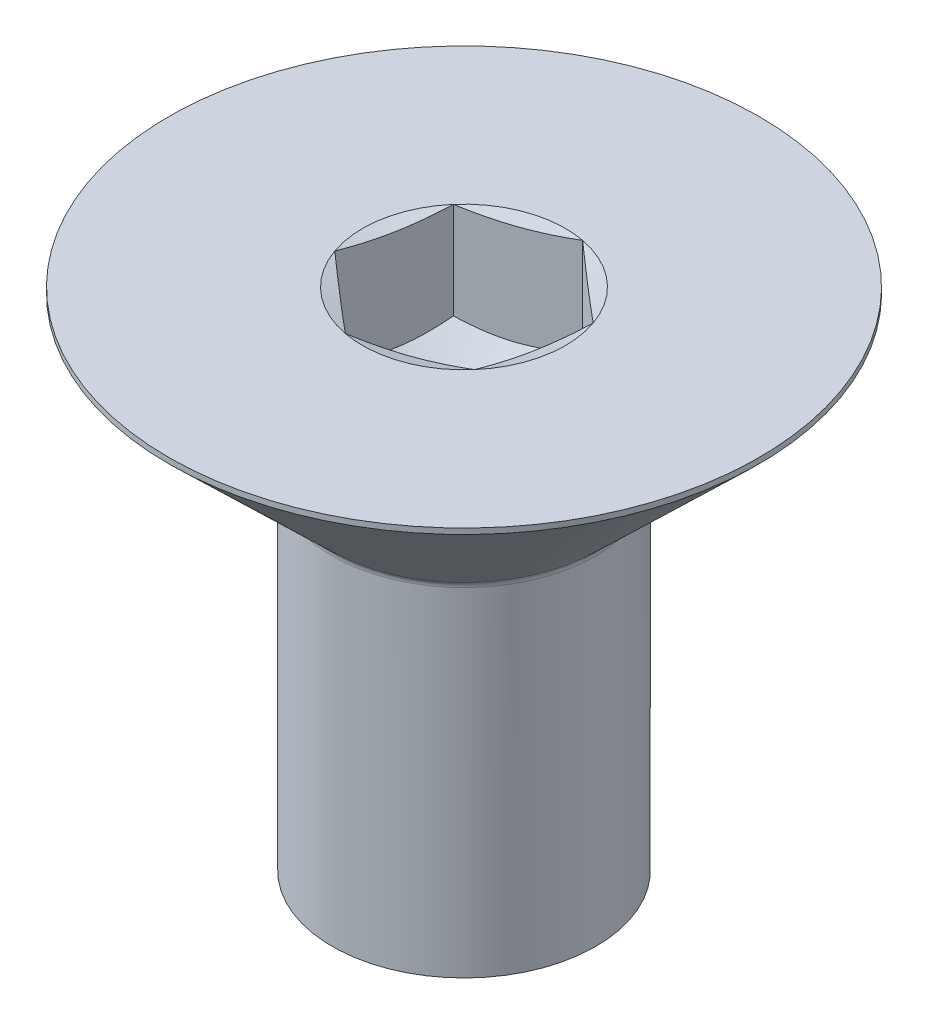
ISO-10303-21;
HEADER;
FILE_DESCRIPTION(('STEP AP214'),'2;1');
FILE_NAME('part.step','',(''),(''),'','','');
FILE_SCHEMA(('AUTOMOTIVE_DESIGN { 1 0 10303 214 1 1 1 1 }'));
ENDSEC;
DATA;
#1=APPLICATION_CONTEXT('core data for automotive mechanical design processes');
#2=APPLICATION_PROTOCOL_DEFINITION('international standard','automotive_design',2000,#1);
#3=PRODUCT_CONTEXT('',#1,'mechanical');
#4=PRODUCT('Part','Part','',(#3));
#5=PRODUCT_RELATED_PRODUCT_CATEGORY('part','',(#4));
#6=PRODUCT_DEFINITION_FORMATION('','',#4);
#7=PRODUCT_DEFINITION_CONTEXT('part definition',#1,'design');
#8=PRODUCT_DEFINITION('design','',#6,#7);
#9=PRODUCT_DEFINITION_SHAPE('','',#8);
#10=(LENGTH_UNIT() NAMED_UNIT(*) SI_UNIT(.MILLI.,.METRE.));
#11=(NAMED_UNIT(*) PLANE_ANGLE_UNIT() SI_UNIT($,.RADIAN.));
#12=(NAMED_UNIT(*) SI_UNIT($,.STERADIAN.) SOLID_ANGLE_UNIT());
#13=UNCERTAINTY_MEASURE_WITH_UNIT(LENGTH_MEASURE(1.E-05),#10,'distance_accuracy_value','');
#14=(GEOMETRIC_REPRESENTATION_CONTEXT(3) GLOBAL_UNCERTAINTY_ASSIGNED_CONTEXT((#13)) GLOBAL_UNIT_ASSIGNED_CONTEXT((#10,
#11,#12)) REPRESENTATION_CONTEXT('',''));
#15=CARTESIAN_POINT('',(0.,0.,0.));
#16=DIRECTION('',(0.,0.,1.));
#17=DIRECTION('',(1.,0.,0.));
#18=AXIS2_PLACEMENT_3D('',#15,#16,#17);
#19=CARTESIAN_POINT('',(1038.73220324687,1026.36700558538,1014.81161803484));
#20=DIRECTION('',(0.,-1.,0.));
#21=DIRECTION('',(-0.94414595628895,0.,0.329527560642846));
#22=AXIS2_PLACEMENT_3D('',#19,#20,#21);
#23=CYLINDRICAL_SURFACE('',#22,1.4999999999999);
#24=CARTESIAN_POINT('',(1038.73220324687,1026.61700558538,1014.81161803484));
#25=DIRECTION('',(0.,1.,0.));
#26=DIRECTION('',(-0.329527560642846,0.,-0.94414595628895));
#27=AXIS2_PLACEMENT_3D('',#24,#25,#26);
#28=CIRCLE('',#27,1.4999999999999);
#29=CARTESIAN_POINT('',(1038.23791190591,1026.61700558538,1013.39539910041));
#30=VERTEX_POINT('',#29);
#31=EDGE_CURVE('E139',#30,#30,#28,.T.);
#32=ORIENTED_EDGE('',*,*,#31,.T.);
#33=EDGE_LOOP('',(#32));
#34=FACE_BOUND('',#33,.T.);
#35=CARTESIAN_POINT('',(1038.73220324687,1030.46455810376,1014.81161803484));
#36=DIRECTION('',(0.,-1.,0.));
#37=DIRECTION('',(-0.94414595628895,0.,0.329527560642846));
#38=AXIS2_PLACEMENT_3D('',#35,#36,#37);
#39=CIRCLE('',#38,1.4999999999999);
#40=CARTESIAN_POINT('',(1037.31598431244,1030.46455810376,1015.3059093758));
#41=VERTEX_POINT('',#40);
#42=EDGE_CURVE('E163',#41,#41,#39,.T.);
#43=ORIENTED_EDGE('',*,*,#42,.T.);
#44=EDGE_LOOP('',(#43));
#45=FACE_BOUND('',#44,.T.);
#46=ADVANCED_FACE('F17',(#34,#45),#23,.T.);
#47=CARTESIAN_POINT('',(1035.55987283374,1032.36700558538,1015.9188306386));
#48=DIRECTION('',(0.,1.,0.));
#49=DIRECTION('',(1.,0.,0.));
#50=AXIS2_PLACEMENT_3D('',#47,#48,#49);
#51=PLANE('',#50);
#52=CARTESIAN_POINT('',(1038.73220324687,1032.36700558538,1014.81161803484));
#53=DIRECTION('',(0.,-1.,0.));
#54=DIRECTION('',(0.944145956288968,0.,-0.329527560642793));
#55=AXIS2_PLACEMENT_3D('',#52,#53,#54);
#56=CIRCLE('',#55,1.15470053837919);
#57=CARTESIAN_POINT('',(1038.94777860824,1032.36700558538,1013.67721925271));
#58=VERTEX_POINT('',#57);
#59=CARTESIAN_POINT('',(1039.8224090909,1032.36700558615,1014.43111238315));
#60=VERTEX_POINT('',#59);
#61=EDGE_CURVE('E108',#58,#60,#56,.T.);
#62=ORIENTED_EDGE('',*,*,#61,.T.);
#63=CARTESIAN_POINT('',(1038.73220324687,1032.36700558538,1014.81161803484));
#64=DIRECTION('',(0.,-1.,0.));
#65=DIRECTION('',(0.944145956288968,0.,-0.329527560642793));
#66=AXIS2_PLACEMENT_3D('',#63,#64,#65);
#67=CIRCLE('',#66,1.15470053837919);
#68=CARTESIAN_POINT('',(1039.60683372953,1032.36700558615,1015.56551116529));
#69=VERTEX_POINT('',#68);
#70=EDGE_CURVE('E180',#60,#69,#67,.T.);
#71=ORIENTED_EDGE('',*,*,#70,.T.);
#72=CARTESIAN_POINT('',(1038.73220324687,1032.36700558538,1014.81161803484));
#73=DIRECTION('',(0.,-1.,0.));
#74=DIRECTION('',(0.944145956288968,0.,-0.329527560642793));
#75=AXIS2_PLACEMENT_3D('',#72,#73,#74);
#76=CIRCLE('',#75,1.15470053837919);
#77=CARTESIAN_POINT('',(1038.51662788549,1032.36700558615,1015.94601681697));
#78=VERTEX_POINT('',#77);
#79=EDGE_CURVE('E178',#69,#78,#76,.T.);
#80=ORIENTED_EDGE('',*,*,#79,.T.);
#81=CARTESIAN_POINT('',(1038.73220324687,1032.36700558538,1014.81161803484));
#82=DIRECTION('',(0.,-1.,0.));
#83=DIRECTION('',(0.944145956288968,0.,-0.329527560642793));
#84=AXIS2_PLACEMENT_3D('',#81,#82,#83);
#85=CIRCLE('',#84,1.15470053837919);
#86=CARTESIAN_POINT('',(1037.64199740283,1032.36700558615,1015.19212368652));
#87=VERTEX_POINT('',#86);
#88=EDGE_CURVE('E112',#78,#87,#85,.T.);
#89=ORIENTED_EDGE('',*,*,#88,.T.);
#90=CARTESIAN_POINT('',(1038.73220324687,1032.36700558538,1014.81161803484));
#91=DIRECTION('',(0.,1.,0.));
#92=DIRECTION('',(-0.329527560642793,0.,-0.944145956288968));
#93=AXIS2_PLACEMENT_3D('',#90,#91,#92);
#94=CIRCLE('',#93,1.15470053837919);
#95=CARTESIAN_POINT('',(1037.85757276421,1032.36700558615,1014.05772490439));
#96=VERTEX_POINT('',#95);
#97=EDGE_CURVE('E93',#96,#87,#94,.T.);
#98=ORIENTED_EDGE('',*,*,#97,.F.);
#99=CARTESIAN_POINT('',(1038.73220324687,1032.36700558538,1014.81161803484));
#100=DIRECTION('',(0.,-1.,0.));
#101=DIRECTION('',(0.944145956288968,0.,-0.329527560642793));
#102=AXIS2_PLACEMENT_3D('',#99,#100,#101);
#103=CIRCLE('',#102,1.15470053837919);
#104=EDGE_CURVE('E100',#96,#58,#103,.T.);
#105=ORIENTED_EDGE('',*,*,#104,.T.);
#106=EDGE_LOOP('',(#62,#71,#80,#89,#98,#105));
#107=FACE_BOUND('',#106,.T.);
#108=CARTESIAN_POINT('',(1038.73220324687,1032.36700558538,1014.81161803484));
#109=DIRECTION('',(0.,-1.,0.));
#110=DIRECTION('',(-0.944145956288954,0.,0.329527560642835));
#111=AXIS2_PLACEMENT_3D('',#108,#109,#110);
#112=CIRCLE('',#111,3.35999999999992);
#113=CARTESIAN_POINT('',(1035.55987283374,1032.36700558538,1015.9188306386));
#114=VERTEX_POINT('',#113);
#115=EDGE_CURVE('E11',#114,#114,#112,.T.);
#116=ORIENTED_EDGE('',*,*,#115,.F.);
#117=EDGE_LOOP('',(#116));
#118=FACE_BOUND('',#117,.T.);
#119=ADVANCED_FACE('F19',(#107,#118),#51,.T.);
#120=CARTESIAN_POINT('',(1038.73220324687,1026.36700558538,1014.81161803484));
#121=DIRECTION('',(0.,-1.,0.));
#122=DIRECTION('',(-0.944145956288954,0.,0.329527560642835));
#123=AXIS2_PLACEMENT_3D('',#120,#121,#122);
#124=CYLINDRICAL_SURFACE('',#123,3.35999999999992);
#125=CARTESIAN_POINT('',(1038.73220324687,1032.30318670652,1014.81161803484));
#126=DIRECTION('',(0.,-1.,0.));
#127=DIRECTION('',(-0.944145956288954,0.,0.329527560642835));
#128=AXIS2_PLACEMENT_3D('',#125,#126,#127);
#129=CIRCLE('',#128,3.35999999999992);
#130=CARTESIAN_POINT('',(1035.55987283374,1032.30318670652,1015.9188306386));
#131=VERTEX_POINT('',#130);
#132=EDGE_CURVE('E34',#131,#131,#129,.T.);
#133=ORIENTED_EDGE('',*,*,#132,.F.);
#134=EDGE_LOOP('',(#133));
#135=FACE_BOUND('',#134,.T.);
#136=ORIENTED_EDGE('',*,*,#115,.T.);
#137=EDGE_LOOP('',(#136));
#138=FACE_BOUND('',#137,.T.);
#139=ADVANCED_FACE('F298',(#135,#138),#124,.T.);
#140=CARTESIAN_POINT('',(1038.73220324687,1030.53649208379,1014.81161803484));
#141=DIRECTION('',(0.,1.,0.));
#142=DIRECTION('',(0.944145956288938,0.,-0.32952756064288));
#143=AXIS2_PLACEMENT_3D('',#140,#141,#142);
#144=CONICAL_SURFACE('',#143,1.53053416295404,0.802851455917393);
#145=ORIENTED_EDGE('',*,*,#132,.T.);
#146=EDGE_LOOP('',(#145));
#147=FACE_BOUND('',#146,.T.);
#148=CARTESIAN_POINT('',(1038.73220324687,1030.53649208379,1014.81161803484));
#149=DIRECTION('',(0.,-1.,0.));
#150=DIRECTION('',(-0.944145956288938,0.,0.32952756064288));
#151=AXIS2_PLACEMENT_3D('',#148,#149,#150);
#152=CIRCLE('',#151,1.53053416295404);
#153=CARTESIAN_POINT('',(1037.28715560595,1030.53649208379,1015.31597122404));
#154=VERTEX_POINT('',#153);
#155=EDGE_CURVE('E162',#154,#154,#152,.T.);
#156=ORIENTED_EDGE('',*,*,#155,.F.);
#157=EDGE_LOOP('',(#156));
#158=FACE_BOUND('',#157,.T.);
#159=ADVANCED_FACE('F295',(#147,#158),#144,.T.);
#160=CARTESIAN_POINT('',(1038.73220324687,1030.46455810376,1014.81161803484));
#161=DIRECTION('',(0.,-1.,0.));
#162=DIRECTION('',(-0.944145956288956,0.,0.329527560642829));
#163=AXIS2_PLACEMENT_3D('',#160,#161,#162);
#164=TOROIDAL_SURFACE('',#163,1.6,0.1);
#165=ORIENTED_EDGE('',*,*,#155,.T.);
#166=EDGE_LOOP('',(#165));
#167=FACE_BOUND('',#166,.T.);
#168=ORIENTED_EDGE('',*,*,#42,.F.);
#169=EDGE_LOOP('',(#168));
#170=FACE_BOUND('',#169,.T.);
#171=ADVANCED_FACE('F297',(#167,#170),#164,.F.);
#172=CARTESIAN_POINT('',(1038.73220324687,2032.03700558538,1014.81161803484));
#173=DIRECTION('',(0.,1.,0.));
#174=DIRECTION('',(-0.329527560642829,0.,-0.944145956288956));
#175=AXIS2_PLACEMENT_3D('',#172,#173,#174);
#176=CONICAL_SURFACE('',#175,3499.09254054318,1.2924281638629);
#177=CARTESIAN_POINT('',(1038.94777860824,1032.36700558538,1013.67721925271));
#178=CARTESIAN_POINT('',(1038.98408327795,1032.36015412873,1013.70851228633));
#179=CARTESIAN_POINT('',(1039.02046264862,1032.35393209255,1013.73986970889));
#180=CARTESIAN_POINT('',(1039.09336747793,1032.34299811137,1013.80271047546));
#181=CARTESIAN_POINT('',(1039.12989299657,1032.33828686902,1013.83419387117));
#182=CARTESIAN_POINT('',(1039.20283855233,1032.33065500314,1013.89706974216));
#183=CARTESIAN_POINT('',(1039.23925795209,1032.32772404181,1013.92846166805));
#184=CARTESIAN_POINT('',(1039.31214952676,1032.32379373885,1013.99129100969));
#185=CARTESIAN_POINT('',(1039.34862168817,1032.32279396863,1014.02272841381));
#186=CARTESIAN_POINT('',(1039.42156601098,1032.32279396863,1014.08560322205));
#187=CARTESIAN_POINT('',(1039.45803817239,1032.32379373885,1014.11704062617));
#188=CARTESIAN_POINT('',(1039.53092974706,1032.32772404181,1014.17986996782));
#189=CARTESIAN_POINT('',(1039.56734914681,1032.33065500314,1014.2112618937));
#190=CARTESIAN_POINT('',(1039.64029470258,1032.33828686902,1014.27413776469));
#191=CARTESIAN_POINT('',(1039.67682022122,1032.34299811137,1014.3056211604));
#192=CARTESIAN_POINT('',(1039.74972505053,1032.35393209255,1014.36846192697));
#193=CARTESIAN_POINT('',(1039.78610442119,1032.36015412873,1014.39981934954));
#194=CARTESIAN_POINT('',(1039.8224090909,1032.36700558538,1014.43111238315));
#195=B_SPLINE_CURVE_WITH_KNOTS('',3,(#177,#178,#179,#180,#181,#182,#183,#184,#185,#186,#187,
#188,#189,#190,#191,#192,#193,#194),.UNSPECIFIED.,.F.,.F.,(4,2,2,2,2,2,2,2,4),(0.,
0.145260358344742,0.290588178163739,0.435063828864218,0.579507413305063,0.723950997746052,
0.86842664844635,1.01375446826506,1.15901482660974),.UNSPECIFIED.);
#196=EDGE_CURVE('E201',#58,#60,#195,.T.);
#197=ORIENTED_EDGE('',*,*,#196,.T.);
#198=ORIENTED_EDGE('',*,*,#61,.F.);
#199=EDGE_LOOP('',(#197,#198));
#200=FACE_BOUND('',#199,.T.);
#201=ADVANCED_FACE('F293',(#200),#176,.F.);
#202=CARTESIAN_POINT('',(1038.73220324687,2032.03700558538,1014.81161803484));
#203=DIRECTION('',(0.,1.,0.));
#204=DIRECTION('',(-0.329527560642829,0.,-0.944145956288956));
#205=AXIS2_PLACEMENT_3D('',#202,#203,#204);
#206=CONICAL_SURFACE('',#205,3499.09254054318,1.2924281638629);
#207=ORIENTED_EDGE('',*,*,#104,.F.);
#208=CARTESIAN_POINT('',(1037.85757276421,1032.36700558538,1014.05772490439));
#209=CARTESIAN_POINT('',(1037.90282566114,1032.36015412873,1014.04193065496));
#210=CARTESIAN_POINT('',(1037.94817167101,1032.35393209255,1014.02610390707));
#211=CARTESIAN_POINT('',(1038.03904578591,1032.34299811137,1013.99438685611));
#212=CARTESIAN_POINT('',(1038.08457396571,1032.33828686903,1013.97849652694));
#213=CARTESIAN_POINT('',(1038.17549884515,1032.33065500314,1013.94676175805));
#214=CARTESIAN_POINT('',(1038.22089475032,1032.32772404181,1013.93091759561));
#215=CARTESIAN_POINT('',(1038.31175234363,1032.32379373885,1013.89920631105));
#216=CARTESIAN_POINT('',(1038.35721401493,1032.32279396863,1013.8833391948));
#217=CARTESIAN_POINT('',(1038.44813735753,1032.32279396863,1013.8516049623));
#218=CARTESIAN_POINT('',(1038.49359902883,1032.32379373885,1013.83573784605));
#219=CARTESIAN_POINT('',(1038.58445662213,1032.32772404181,1013.80402656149));
#220=CARTESIAN_POINT('',(1038.6298525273,1032.33065500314,1013.78818239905));
#221=CARTESIAN_POINT('',(1038.72077740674,1032.33828686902,1013.75644763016));
#222=CARTESIAN_POINT('',(1038.76630558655,1032.34299811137,1013.74055730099));
#223=CARTESIAN_POINT('',(1038.85717970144,1032.35393209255,1013.70884025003));
#224=CARTESIAN_POINT('',(1038.90252571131,1032.36015412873,1013.69301350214));
#225=CARTESIAN_POINT('',(1038.94777860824,1032.36700558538,1013.67721925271));
#226=B_SPLINE_CURVE_WITH_KNOTS('',3,(#208,#209,#210,#211,#212,#213,#214,#215,#216,#217,#218,
#219,#220,#221,#222,#223,#224,#225),.UNSPECIFIED.,.F.,.F.,(4,2,2,2,2,2,2,2,4),(0.,
0.145260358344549,0.290588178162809,0.435063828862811,0.579507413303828,0.723950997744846,
0.868426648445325,1.01375446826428,1.15901482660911),.UNSPECIFIED.);
#227=EDGE_CURVE('E103',#96,#58,#226,.T.);
#228=ORIENTED_EDGE('',*,*,#227,.T.);
#229=EDGE_LOOP('',(#207,#228));
#230=FACE_BOUND('',#229,.T.);
#231=ADVANCED_FACE('F101',(#230),#206,.F.);
#232=CARTESIAN_POINT('',(1038.73220324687,2032.03700558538,1014.81161803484));
#233=DIRECTION('',(0.,1.,0.));
#234=DIRECTION('',(-0.329527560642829,0.,-0.944145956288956));
#235=AXIS2_PLACEMENT_3D('',#232,#233,#234);
#236=CONICAL_SURFACE('',#235,3499.09254054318,1.2924281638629);
#237=CARTESIAN_POINT('',(1037.64199740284,1032.36700558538,1015.19212368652));
#238=CARTESIAN_POINT('',(1037.65094563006,1032.36015412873,1015.14503640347));
#239=CARTESIAN_POINT('',(1037.65991226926,1032.35393209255,1015.09785223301));
#240=CARTESIAN_POINT('',(1037.67788155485,1032.34299811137,1015.00329441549));
#241=CARTESIAN_POINT('',(1037.68688421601,1032.33828686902,1014.95592069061));
#242=CARTESIAN_POINT('',(1037.70486353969,1032.33065500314,1014.86131005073));
#243=CARTESIAN_POINT('',(1037.7138400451,1032.32772404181,1014.81407396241));
#244=CARTESIAN_POINT('',(1037.73180606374,1032.32379373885,1014.7195333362));
#245=CARTESIAN_POINT('',(1037.74079557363,1032.32279396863,1014.67222881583));
#246=CARTESIAN_POINT('',(1037.75877459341,1032.32279396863,1014.57761977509));
#247=CARTESIAN_POINT('',(1037.76776410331,1032.32379373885,1014.53031525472));
#248=CARTESIAN_POINT('',(1037.78573012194,1032.32772404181,1014.43577462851));
#249=CARTESIAN_POINT('',(1037.79470662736,1032.33065500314,1014.38853854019));
#250=CARTESIAN_POINT('',(1037.81268595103,1032.33828686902,1014.29392790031));
#251=CARTESIAN_POINT('',(1037.8216886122,1032.34299811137,1014.24655417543));
#252=CARTESIAN_POINT('',(1037.83965789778,1032.35393209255,1014.1519963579));
#253=CARTESIAN_POINT('',(1037.84862453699,1032.36015412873,1014.10481218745));
#254=CARTESIAN_POINT('',(1037.85757276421,1032.36700558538,1014.05772490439));
#255=B_SPLINE_CURVE_WITH_KNOTS('',3,(#237,#238,#239,#240,#241,#242,#243,#244,#245,#246,#247,
#248,#249,#250,#251,#252,#253,#254),.UNSPECIFIED.,.F.,.F.,(4,2,2,2,2,2,2,2,4),(0.,
0.145260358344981,0.29058817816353,0.435063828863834,0.579507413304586,0.723950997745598,
0.868426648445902,1.01375446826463,1.15901482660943),.UNSPECIFIED.);
#256=EDGE_CURVE('E21',#87,#96,#255,.T.);
#257=ORIENTED_EDGE('',*,*,#256,.T.);
#258=ORIENTED_EDGE('',*,*,#97,.T.);
#259=EDGE_LOOP('',(#257,#258));
#260=FACE_BOUND('',#259,.T.);
#261=ADVANCED_FACE('F136',(#260),#236,.F.);
#262=CARTESIAN_POINT('',(1038.73220324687,2032.03700558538,1014.81161803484));
#263=DIRECTION('',(0.,1.,0.));
#264=DIRECTION('',(-0.329527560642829,0.,-0.944145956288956));
#265=AXIS2_PLACEMENT_3D('',#262,#263,#264);
#266=CONICAL_SURFACE('',#265,3499.09254054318,1.2924281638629);
#267=CARTESIAN_POINT('',(1038.51662788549,1032.36700558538,1015.94601681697));
#268=CARTESIAN_POINT('',(1038.48032321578,1032.36015412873,1015.91472378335));
#269=CARTESIAN_POINT('',(1038.44394384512,1032.35393209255,1015.88336636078));
#270=CARTESIAN_POINT('',(1038.37103901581,1032.34299811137,1015.82052559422));
#271=CARTESIAN_POINT('',(1038.33451349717,1032.33828686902,1015.7890421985));
#272=CARTESIAN_POINT('',(1038.2615679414,1032.33065500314,1015.72616632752));
#273=CARTESIAN_POINT('',(1038.22514854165,1032.32772404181,1015.69477440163));
#274=CARTESIAN_POINT('',(1038.15225696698,1032.32379373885,1015.63194505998));
#275=CARTESIAN_POINT('',(1038.11578480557,1032.32279396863,1015.60050765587));
#276=CARTESIAN_POINT('',(1038.04284048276,1032.32279396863,1015.53763284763));
#277=CARTESIAN_POINT('',(1038.00636832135,1032.32379373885,1015.50619544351));
#278=CARTESIAN_POINT('',(1037.93347674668,1032.32772404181,1015.44336610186));
#279=CARTESIAN_POINT('',(1037.89705734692,1032.33065500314,1015.41197417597));
#280=CARTESIAN_POINT('',(1037.82411179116,1032.33828686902,1015.34909830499));
#281=CARTESIAN_POINT('',(1037.78758627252,1032.34299811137,1015.31761490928));
#282=CARTESIAN_POINT('',(1037.71468144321,1032.35393209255,1015.25477414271));
#283=CARTESIAN_POINT('',(1037.67830207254,1032.36015412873,1015.22341672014));
#284=CARTESIAN_POINT('',(1037.64199740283,1032.36700558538,1015.19212368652));
#285=B_SPLINE_CURVE_WITH_KNOTS('',3,(#267,#268,#269,#270,#271,#272,#273,#274,#275,#276,#277,
#278,#279,#280,#281,#282,#283,#284),.UNSPECIFIED.,.F.,.F.,(4,2,2,2,2,2,2,2,4),(0.,
0.145260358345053,0.290588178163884,0.435063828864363,0.579507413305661,0.723950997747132,
0.868426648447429,1.01375446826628,1.15901482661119),.UNSPECIFIED.);
#286=EDGE_CURVE('E174',#78,#87,#285,.T.);
#287=ORIENTED_EDGE('',*,*,#286,.T.);
#288=ORIENTED_EDGE('',*,*,#88,.F.);
#289=EDGE_LOOP('',(#287,#288));
#290=FACE_BOUND('',#289,.T.);
#291=ADVANCED_FACE('F329',(#290),#266,.F.);
#292=CARTESIAN_POINT('',(1038.73220324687,2032.03700558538,1014.81161803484));
#293=DIRECTION('',(0.,1.,0.));
#294=DIRECTION('',(-0.329527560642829,0.,-0.944145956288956));
#295=AXIS2_PLACEMENT_3D('',#292,#293,#294);
#296=CONICAL_SURFACE('',#295,3499.09254054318,1.2924281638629);
#297=CARTESIAN_POINT('',(1039.60683372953,1032.36700558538,1015.56551116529));
#298=CARTESIAN_POINT('',(1039.5615808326,1032.36015412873,1015.58130541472));
#299=CARTESIAN_POINT('',(1039.51623482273,1032.35393209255,1015.59713216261));
#300=CARTESIAN_POINT('',(1039.42536070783,1032.34299811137,1015.62884921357));
#301=CARTESIAN_POINT('',(1039.37983252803,1032.33828686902,1015.64473954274));
#302=CARTESIAN_POINT('',(1039.28890764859,1032.33065500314,1015.67647431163));
#303=CARTESIAN_POINT('',(1039.24351174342,1032.32772404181,1015.69231847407));
#304=CARTESIAN_POINT('',(1039.15265415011,1032.32379373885,1015.72402975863));
#305=CARTESIAN_POINT('',(1039.10719247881,1032.32279396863,1015.73989687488));
#306=CARTESIAN_POINT('',(1039.01626913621,1032.32279396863,1015.77163110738));
#307=CARTESIAN_POINT('',(1038.97080746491,1032.32379373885,1015.78749822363));
#308=CARTESIAN_POINT('',(1038.87994987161,1032.32772404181,1015.81920950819));
#309=CARTESIAN_POINT('',(1038.83455396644,1032.33065500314,1015.83505367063));
#310=CARTESIAN_POINT('',(1038.743629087,1032.33828686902,1015.86678843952));
#311=CARTESIAN_POINT('',(1038.69810090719,1032.34299811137,1015.88267876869));
#312=CARTESIAN_POINT('',(1038.6072267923,1032.35393209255,1015.91439581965));
#313=CARTESIAN_POINT('',(1038.56188078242,1032.36015412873,1015.93022256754));
#314=CARTESIAN_POINT('',(1038.51662788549,1032.36700558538,1015.94601681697));
#315=B_SPLINE_CURVE_WITH_KNOTS('',3,(#297,#298,#299,#300,#301,#302,#303,#304,#305,#306,#307,
#308,#309,#310,#311,#312,#313,#314),.UNSPECIFIED.,.F.,.F.,(4,2,2,2,2,2,2,2,4),(0.,
0.145260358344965,0.290588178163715,0.435063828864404,0.579507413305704,0.723950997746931,
0.868426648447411,1.01375446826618,1.15901482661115),.UNSPECIFIED.);
#316=EDGE_CURVE('E186',#69,#78,#315,.T.);
#317=ORIENTED_EDGE('',*,*,#316,.T.);
#318=ORIENTED_EDGE('',*,*,#79,.F.);
#319=EDGE_LOOP('',(#317,#318));
#320=FACE_BOUND('',#319,.T.);
#321=ADVANCED_FACE('F326',(#320),#296,.F.);
#322=CARTESIAN_POINT('',(1038.73220324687,2032.03700558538,1014.81161803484));
#323=DIRECTION('',(0.,1.,0.));
#324=DIRECTION('',(-0.329527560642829,0.,-0.944145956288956));
#325=AXIS2_PLACEMENT_3D('',#322,#323,#324);
#326=CONICAL_SURFACE('',#325,3499.09254054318,1.2924281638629);
#327=CARTESIAN_POINT('',(1039.8224090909,1032.36700558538,1014.43111238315));
#328=CARTESIAN_POINT('',(1039.81346086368,1032.36015412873,1014.47819966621));
#329=CARTESIAN_POINT('',(1039.80449422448,1032.35393209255,1014.52538383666));
#330=CARTESIAN_POINT('',(1039.78652493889,1032.34299811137,1014.61994165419));
#331=CARTESIAN_POINT('',(1039.77752227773,1032.33828686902,1014.66731537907));
#332=CARTESIAN_POINT('',(1039.75954295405,1032.33065500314,1014.76192601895));
#333=CARTESIAN_POINT('',(1039.75056644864,1032.32772404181,1014.80916210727));
#334=CARTESIAN_POINT('',(1039.73260043,1032.32379373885,1014.90370273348));
#335=CARTESIAN_POINT('',(1039.72361092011,1032.32279396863,1014.95100725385));
#336=CARTESIAN_POINT('',(1039.70563190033,1032.32279396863,1015.04561629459));
#337=CARTESIAN_POINT('',(1039.69664239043,1032.32379373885,1015.09292081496));
#338=CARTESIAN_POINT('',(1039.6786763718,1032.32772404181,1015.18746144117));
#339=CARTESIAN_POINT('',(1039.66969986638,1032.33065500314,1015.23469752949));
#340=CARTESIAN_POINT('',(1039.65172054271,1032.33828686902,1015.32930816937));
#341=CARTESIAN_POINT('',(1039.64271788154,1032.34299811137,1015.37668189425));
#342=CARTESIAN_POINT('',(1039.62474859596,1032.35393209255,1015.47123971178));
#343=CARTESIAN_POINT('',(1039.61578195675,1032.36015412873,1015.51842388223));
#344=CARTESIAN_POINT('',(1039.60683372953,1032.36700558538,1015.56551116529));
#345=B_SPLINE_CURVE_WITH_KNOTS('',3,(#327,#328,#329,#330,#331,#332,#333,#334,#335,#336,#337,
#338,#339,#340,#341,#342,#343,#344),.UNSPECIFIED.,.F.,.F.,(4,2,2,2,2,2,2,2,4),(0.,
0.145260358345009,0.290588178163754,0.435063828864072,0.579507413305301,0.72395099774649,
0.868426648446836,1.01375446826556,1.15901482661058),.UNSPECIFIED.);
#346=EDGE_CURVE('E196',#60,#69,#345,.T.);
#347=ORIENTED_EDGE('',*,*,#346,.T.);
#348=ORIENTED_EDGE('',*,*,#70,.F.);
#349=EDGE_LOOP('',(#347,#348));
#350=FACE_BOUND('',#349,.T.);
#351=ADVANCED_FACE('F225',(#350),#326,.F.);
#352=CARTESIAN_POINT('',(1038.73220324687,1031.26700558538,1014.81161803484));
#353=DIRECTION('',(0.,1.,0.));
#354=DIRECTION('',(-0.329527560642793,0.,-0.944145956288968));
#355=AXIS2_PLACEMENT_3D('',#352,#353,#354);
#356=CONICAL_SURFACE('',#355,1.15470053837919,1.0471975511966);
#357=CARTESIAN_POINT('',(1037.64199740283,1031.26700558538,1015.19212368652));
#358=CARTESIAN_POINT('',(1037.68043211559,1031.25235335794,1015.22525272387));
#359=CARTESIAN_POINT('',(1037.71919859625,1031.23902792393,1015.25866773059));
#360=CARTESIAN_POINT('',(1037.79740277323,1031.21576877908,1015.32607630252));
#361=CARTESIAN_POINT('',(1037.83684185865,1031.20584329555,1015.36007106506));
#362=CARTESIAN_POINT('',(1037.91523128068,1031.19039356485,1015.42763931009));
#363=CARTESIAN_POINT('',(1037.95416955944,1031.18476647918,1015.46120239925));
#364=CARTESIAN_POINT('',(1038.03222923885,1031.17805016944,1015.5284864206));
#365=CARTESIAN_POINT('',(1038.07135035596,1031.17695538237,1015.5622071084));
#366=CARTESIAN_POINT('',(1038.14444396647,1031.17923873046,1015.62521059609));
#367=CARTESIAN_POINT('',(1038.17842742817,1031.18205622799,1015.65450285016));
#368=CARTESIAN_POINT('',(1038.24617296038,1031.19098423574,1015.71289652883));
#369=CARTESIAN_POINT('',(1038.27993479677,1031.19709779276,1015.7419977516));
#370=CARTESIAN_POINT('',(1038.34781989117,1031.21238050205,1015.80051172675));
#371=CARTESIAN_POINT('',(1038.38193456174,1031.22161440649,1015.82991707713));
#372=CARTESIAN_POINT('',(1038.44965522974,1031.2425714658,1015.88828932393));
#373=CARTESIAN_POINT('',(1038.48326209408,1031.25428969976,1015.9172569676));
#374=CARTESIAN_POINT('',(1038.51662788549,1031.26700558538,1015.94601681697));
#375=B_SPLINE_CURVE_WITH_KNOTS('',3,(#357,#358,#359,#360,#361,#362,#363,#364,#365,#366,#367,
#368,#369,#370,#371,#372,#373,#374),.UNSPECIFIED.,.F.,.F.,(4,2,2,2,2,2,2,2,4),(0.,
0.158508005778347,0.317396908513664,0.472353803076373,0.62712044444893,0.761853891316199,
0.896712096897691,1.03456081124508,1.17213898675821),.UNSPECIFIED.);
#376=CARTESIAN_POINT('',(1037.64199740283,1031.26700558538,1015.19212368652));
#377=VERTEX_POINT('',#376);
#378=CARTESIAN_POINT('',(1038.51662788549,1031.26700558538,1015.94601681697));
#379=VERTEX_POINT('',#378);
#380=EDGE_CURVE('E191',#377,#379,#375,.T.);
#381=ORIENTED_EDGE('',*,*,#380,.T.);
#382=CARTESIAN_POINT('',(1038.51662788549,1031.26700558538,1015.94601681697));
#383=CARTESIAN_POINT('',(1038.56137543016,1031.25332247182,1015.93039894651));
#384=CARTESIAN_POINT('',(1038.60647696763,1031.24079519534,1015.91465752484));
#385=CARTESIAN_POINT('',(1038.69741268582,1031.21865478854,1015.88291897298));
#386=CARTESIAN_POINT('',(1038.74324826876,1031.20904817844,1015.8669213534));
#387=CARTESIAN_POINT('',(1038.83440511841,1031.19359958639,1015.83510562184));
#388=CARTESIAN_POINT('',(1038.87971355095,1031.18767523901,1015.81929198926));
#389=CARTESIAN_POINT('',(1038.97059181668,1031.17972215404,1015.78757348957));
#390=CARTESIAN_POINT('',(1039.0161613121,1031.1776891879,1015.77166874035));
#391=CARTESIAN_POINT('',(1039.10730030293,1031.1776891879,1015.73985924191));
#392=CARTESIAN_POINT('',(1039.15286979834,1031.17972215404,1015.72395449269));
#393=CARTESIAN_POINT('',(1039.24374806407,1031.18767523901,1015.692235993));
#394=CARTESIAN_POINT('',(1039.28905649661,1031.19359958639,1015.67642236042));
#395=CARTESIAN_POINT('',(1039.38021334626,1031.20904817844,1015.64460662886));
#396=CARTESIAN_POINT('',(1039.42604892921,1031.21865478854,1015.62860900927));
#397=CARTESIAN_POINT('',(1039.51698464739,1031.24079519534,1015.59687045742));
#398=CARTESIAN_POINT('',(1039.56208618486,1031.25332247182,1015.58112903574));
#399=CARTESIAN_POINT('',(1039.60683372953,1031.26700558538,1015.56551116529));
#400=B_SPLINE_CURVE_WITH_KNOTS('',3,(#382,#383,#384,#385,#386,#387,#388,#389,#390,#391,#392,
#393,#394,#395,#396,#397,#398,#399),.UNSPECIFIED.,.F.,.F.,(4,2,2,2,2,2,2,2,4),(0.,
0.14803669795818,0.296401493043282,0.441315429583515,0.586071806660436,0.730828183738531,
0.875742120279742,1.0241069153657,1.17214361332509),.UNSPECIFIED.);
#401=CARTESIAN_POINT('',(1039.60683372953,1031.26700558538,1015.56551116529));
#402=VERTEX_POINT('',#401);
#403=EDGE_CURVE('E175',#379,#402,#400,.T.);
#404=ORIENTED_EDGE('',*,*,#403,.T.);
#405=CARTESIAN_POINT('',(1039.60683372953,1031.26700558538,1015.56551116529));
#406=CARTESIAN_POINT('',(1039.61630696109,1031.25235335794,1015.51566120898));
#407=CARTESIAN_POINT('',(1039.62586196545,1031.23902792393,1015.46538094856));
#408=CARTESIAN_POINT('',(1039.64513741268,1031.21576877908,1015.36394985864));
#409=CARTESIAN_POINT('',(1039.65485819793,1031.20584329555,1015.31279722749));
#410=CARTESIAN_POINT('',(1039.6741793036,1031.19039356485,1015.21112587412));
#411=CARTESIAN_POINT('',(1039.68377665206,1031.18476647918,1015.16062279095));
#412=CARTESIAN_POINT('',(1039.70301648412,1031.17805016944,1015.05937911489));
#413=CARTESIAN_POINT('',(1039.71265889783,1031.17695538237,1015.00863888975));
#414=CARTESIAN_POINT('',(1039.73067471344,1031.17923873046,1014.91383622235));
#415=CARTESIAN_POINT('',(1039.73905081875,1031.18205622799,1014.86975955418));
#416=CARTESIAN_POINT('',(1039.75574846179,1031.19098423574,1014.78189336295));
#417=CARTESIAN_POINT('',(1039.7640699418,1031.19709779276,1014.73810414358));
#418=CARTESIAN_POINT('',(1039.78080198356,1031.21238050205,1014.65005693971));
#419=CARTESIAN_POINT('',(1039.78921042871,1031.22161440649,1014.60581009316));
#420=CARTESIAN_POINT('',(1039.80590194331,1031.2425714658,1014.51797615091));
#421=CARTESIAN_POINT('',(1039.81418522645,1031.25428969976,1014.47438793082));
#422=CARTESIAN_POINT('',(1039.82240909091,1031.26700558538,1014.43111238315));
#423=B_SPLINE_CURVE_WITH_KNOTS('',3,(#405,#406,#407,#408,#409,#410,#411,#412,#413,#414,#415,
#416,#417,#418,#419,#420,#421,#422),.UNSPECIFIED.,.F.,.F.,(4,2,2,2,2,2,2,2,4),(0.,
0.158508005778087,0.317396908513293,0.472353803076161,0.62712044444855,0.761853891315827,
0.896712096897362,1.03456081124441,1.17213898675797),.UNSPECIFIED.);
#424=CARTESIAN_POINT('',(1039.8224090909,1031.26700558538,1014.43111238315));
#425=VERTEX_POINT('',#424);
#426=EDGE_CURVE('E187',#402,#425,#423,.T.);
#427=ORIENTED_EDGE('',*,*,#426,.T.);
#428=CARTESIAN_POINT('',(1039.8224090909,1031.26700558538,1014.43111238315));
#429=CARTESIAN_POINT('',(1039.78397437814,1031.25235335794,1014.39798334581));
#430=CARTESIAN_POINT('',(1039.74520789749,1031.23902792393,1014.36456833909));
#431=CARTESIAN_POINT('',(1039.6670037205,1031.21576877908,1014.29715976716));
#432=CARTESIAN_POINT('',(1039.62756463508,1031.20584329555,1014.26316500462));
#433=CARTESIAN_POINT('',(1039.54917521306,1031.19039356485,1014.19559675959));
#434=CARTESIAN_POINT('',(1039.5102369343,1031.18476647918,1014.16203367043));
#435=CARTESIAN_POINT('',(1039.43217725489,1031.17805016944,1014.09474964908));
#436=CARTESIAN_POINT('',(1039.39305613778,1031.17695538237,1014.06102896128));
#437=CARTESIAN_POINT('',(1039.31996252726,1031.17923873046,1013.99802547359));
#438=CARTESIAN_POINT('',(1039.28597906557,1031.18205622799,1013.96873321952));
#439=CARTESIAN_POINT('',(1039.21823353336,1031.19098423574,1013.91033954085));
#440=CARTESIAN_POINT('',(1039.18447169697,1031.19709779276,1013.88123831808));
#441=CARTESIAN_POINT('',(1039.11658660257,1031.21238050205,1013.82272434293));
#442=CARTESIAN_POINT('',(1039.082471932,1031.22161440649,1013.79331899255));
#443=CARTESIAN_POINT('',(1039.01475126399,1031.2425714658,1013.73494674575));
#444=CARTESIAN_POINT('',(1038.98114439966,1031.25428969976,1013.70597910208));
#445=CARTESIAN_POINT('',(1038.94777860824,1031.26700558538,1013.67721925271));
#446=B_SPLINE_CURVE_WITH_KNOTS('',3,(#428,#429,#430,#431,#432,#433,#434,#435,#436,#437,#438,
#439,#440,#441,#442,#443,#444,#445),.UNSPECIFIED.,.F.,.F.,(4,2,2,2,2,2,2,2,4),(0.,
0.158508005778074,0.317396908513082,0.472353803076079,0.627120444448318,0.761853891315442,
0.896712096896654,1.03456081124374,1.17213898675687),.UNSPECIFIED.);
#447=CARTESIAN_POINT('',(1038.94777860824,1031.26700558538,1013.67721925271));
#448=VERTEX_POINT('',#447);
#449=EDGE_CURVE('E197',#425,#448,#446,.T.);
#450=ORIENTED_EDGE('',*,*,#449,.T.);
#451=CARTESIAN_POINT('',(1038.94777860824,1031.26700558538,1013.67721925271));
#452=CARTESIAN_POINT('',(1038.90303106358,1031.25332247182,1013.69283712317));
#453=CARTESIAN_POINT('',(1038.85792952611,1031.24079519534,1013.70857854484));
#454=CARTESIAN_POINT('',(1038.76699380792,1031.21865478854,1013.7403170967));
#455=CARTESIAN_POINT('',(1038.72115822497,1031.20904817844,1013.75631471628));
#456=CARTESIAN_POINT('',(1038.63000137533,1031.19359958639,1013.78813044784));
#457=CARTESIAN_POINT('',(1038.58469294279,1031.18767523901,1013.80394408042));
#458=CARTESIAN_POINT('',(1038.49381467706,1031.17972215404,1013.83566258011));
#459=CARTESIAN_POINT('',(1038.44824518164,1031.1776891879,1013.85156732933));
#460=CARTESIAN_POINT('',(1038.35710619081,1031.1776891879,1013.88337682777));
#461=CARTESIAN_POINT('',(1038.3115366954,1031.17972215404,1013.89928157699));
#462=CARTESIAN_POINT('',(1038.22065842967,1031.18767523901,1013.93100007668));
#463=CARTESIAN_POINT('',(1038.17534999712,1031.19359958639,1013.94681370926));
#464=CARTESIAN_POINT('',(1038.08419314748,1031.20904817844,1013.97862944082));
#465=CARTESIAN_POINT('',(1038.03835756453,1031.21865478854,1013.99462706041));
#466=CARTESIAN_POINT('',(1037.94742184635,1031.24079519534,1014.02636561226));
#467=CARTESIAN_POINT('',(1037.90232030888,1031.25332247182,1014.04210703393));
#468=CARTESIAN_POINT('',(1037.85757276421,1031.26700558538,1014.05772490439));
#469=B_SPLINE_CURVE_WITH_KNOTS('',3,(#451,#452,#453,#454,#455,#456,#457,#458,#459,#460,#461,
#462,#463,#464,#465,#466,#467,#468),.UNSPECIFIED.,.F.,.F.,(4,2,2,2,2,2,2,2,4),(0.,
0.148036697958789,0.296401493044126,0.44131542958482,0.586071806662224,0.730828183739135,
0.875742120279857,1.02410691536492,1.17214361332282),.UNSPECIFIED.);
#470=CARTESIAN_POINT('',(1037.85757276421,1031.26700558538,1014.05772490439));
#471=VERTEX_POINT('',#470);
#472=EDGE_CURVE('E126',#448,#471,#469,.T.);
#473=ORIENTED_EDGE('',*,*,#472,.T.);
#474=CARTESIAN_POINT('',(1037.85757276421,1031.26700558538,1014.05772490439));
#475=CARTESIAN_POINT('',(1037.84809953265,1031.25235335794,1014.1075748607));
#476=CARTESIAN_POINT('',(1037.83854452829,1031.23902792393,1014.15785512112));
#477=CARTESIAN_POINT('',(1037.81926908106,1031.21576877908,1014.25928621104));
#478=CARTESIAN_POINT('',(1037.80954829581,1031.20584329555,1014.31043884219));
#479=CARTESIAN_POINT('',(1037.79022719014,1031.19039356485,1014.41211019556));
#480=CARTESIAN_POINT('',(1037.78062984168,1031.18476647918,1014.46261327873));
#481=CARTESIAN_POINT('',(1037.76139000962,1031.17805016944,1014.56385695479));
#482=CARTESIAN_POINT('',(1037.75174759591,1031.17695538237,1014.61459717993));
#483=CARTESIAN_POINT('',(1037.7337317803,1031.17923873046,1014.70939984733));
#484=CARTESIAN_POINT('',(1037.72535567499,1031.18205622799,1014.7534765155));
#485=CARTESIAN_POINT('',(1037.70865803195,1031.19098423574,1014.84134270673));
#486=CARTESIAN_POINT('',(1037.70033655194,1031.19709779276,1014.8851319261));
#487=CARTESIAN_POINT('',(1037.68360451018,1031.21238050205,1014.97317912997));
#488=CARTESIAN_POINT('',(1037.67519606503,1031.22161440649,1015.01742597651));
#489=CARTESIAN_POINT('',(1037.65850455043,1031.2425714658,1015.10525991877));
#490=CARTESIAN_POINT('',(1037.65022126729,1031.25428969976,1015.14884813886));
#491=CARTESIAN_POINT('',(1037.64199740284,1031.26700558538,1015.19212368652));
#492=B_SPLINE_CURVE_WITH_KNOTS('',3,(#474,#475,#476,#477,#478,#479,#480,#481,#482,#483,#484,
#485,#486,#487,#488,#489,#490,#491),.UNSPECIFIED.,.F.,.F.,(4,2,2,2,2,2,2,2,4),(0.,
0.158508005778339,0.317396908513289,0.472353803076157,0.627120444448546,0.76185389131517,
0.896712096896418,1.03456081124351,1.17213898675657),.UNSPECIFIED.);
#493=EDGE_CURVE('E133',#471,#377,#492,.T.);
#494=ORIENTED_EDGE('',*,*,#493,.T.);
#495=EDGE_LOOP('',(#381,#404,#427,#450,#473,#494));
#496=FACE_BOUND('',#495,.T.);
#497=CARTESIAN_POINT('',(1038.73220324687,1030.60033891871,1014.81161803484));
#498=VERTEX_POINT('',#497);
#499=VERTEX_LOOP('',#498);
#500=FACE_BOUND('',#499,.T.);
#501=ADVANCED_FACE('F221',(#496,#500),#356,.F.);
#502=CARTESIAN_POINT('',(1037.64199740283,1030.40700558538,1015.19212368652));
#503=DIRECTION('',(-0.652890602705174,0.,0.757452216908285));
#504=DIRECTION('',(0.,1.,0.));
#505=AXIS2_PLACEMENT_3D('',#502,#503,#504);
#506=PLANE('',#505);
#507=ORIENTED_EDGE('',*,*,#286,.F.);
#508=DIRECTION('',(0.,1.,0.));
#509=VECTOR('',#508,1.);
#510=CARTESIAN_POINT('',(1038.51662788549,1030.40700558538,1015.94601681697));
#511=LINE('',#510,#509);
#512=EDGE_CURVE('E170',#379,#78,#511,.T.);
#513=ORIENTED_EDGE('',*,*,#512,.F.);
#514=ORIENTED_EDGE('',*,*,#380,.F.);
#515=DIRECTION('',(0.,1.,0.));
#516=VECTOR('',#515,1.);
#517=CARTESIAN_POINT('',(1037.64199740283,1030.40700558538,1015.19212368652));
#518=LINE('',#517,#516);
#519=EDGE_CURVE('E138',#377,#87,#518,.T.);
#520=ORIENTED_EDGE('',*,*,#519,.T.);
#521=EDGE_LOOP('',(#507,#513,#514,#520));
#522=FACE_BOUND('',#521,.T.);
#523=ADVANCED_FACE('F218',(#522),#506,.F.);
#524=CARTESIAN_POINT('',(1038.51662788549,1030.40700558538,1015.94601681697));
#525=DIRECTION('',(0.329527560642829,0.,0.944145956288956));
#526=DIRECTION('',(0.,-1.,0.));
#527=AXIS2_PLACEMENT_3D('',#524,#525,#526);
#528=PLANE('',#527);
#529=ORIENTED_EDGE('',*,*,#316,.F.);
#530=DIRECTION('',(0.,1.,0.));
#531=VECTOR('',#530,1.);
#532=CARTESIAN_POINT('',(1039.60683372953,1030.40700558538,1015.56551116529));
#533=LINE('',#532,#531);
#534=EDGE_CURVE('E182',#402,#69,#533,.T.);
#535=ORIENTED_EDGE('',*,*,#534,.F.);
#536=ORIENTED_EDGE('',*,*,#403,.F.);
#537=ORIENTED_EDGE('',*,*,#512,.T.);
#538=EDGE_LOOP('',(#529,#535,#536,#537));
#539=FACE_BOUND('',#538,.T.);
#540=ADVANCED_FACE('F274',(#539),#528,.F.);
#541=CARTESIAN_POINT('',(1039.60683372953,1030.40700558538,1015.56551116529));
#542=DIRECTION('',(0.982418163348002,0.,0.18669373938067));
#543=DIRECTION('',(0.,-1.,0.));
#544=AXIS2_PLACEMENT_3D('',#541,#542,#543);
#545=PLANE('',#544);
#546=ORIENTED_EDGE('',*,*,#346,.F.);
#547=DIRECTION('',(0.,1.,0.));
#548=VECTOR('',#547,1.);
#549=CARTESIAN_POINT('',(1039.8224090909,1030.40700558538,1014.43111238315));
#550=LINE('',#549,#548);
#551=EDGE_CURVE('E192',#425,#60,#550,.T.);
#552=ORIENTED_EDGE('',*,*,#551,.F.);
#553=ORIENTED_EDGE('',*,*,#426,.F.);
#554=ORIENTED_EDGE('',*,*,#534,.T.);
#555=EDGE_LOOP('',(#546,#552,#553,#554));
#556=FACE_BOUND('',#555,.T.);
#557=ADVANCED_FACE('F272',(#556),#545,.F.);
#558=CARTESIAN_POINT('',(1039.8224090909,1030.40700558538,1014.43111238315));
#559=DIRECTION('',(0.652890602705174,0.,-0.757452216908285));
#560=DIRECTION('',(0.,-1.,0.));
#561=AXIS2_PLACEMENT_3D('',#558,#559,#560);
#562=PLANE('',#561);
#563=ORIENTED_EDGE('',*,*,#196,.F.);
#564=DIRECTION('',(0.,1.,0.));
#565=VECTOR('',#564,1.);
#566=CARTESIAN_POINT('',(1038.94777860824,1030.40700558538,1013.67721925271));
#567=LINE('',#566,#565);
#568=EDGE_CURVE('E124',#448,#58,#567,.T.);
#569=ORIENTED_EDGE('',*,*,#568,.F.);
#570=ORIENTED_EDGE('',*,*,#449,.F.);
#571=ORIENTED_EDGE('',*,*,#551,.T.);
#572=EDGE_LOOP('',(#563,#569,#570,#571));
#573=FACE_BOUND('',#572,.T.);
#574=ADVANCED_FACE('F269',(#573),#562,.F.);
#575=CARTESIAN_POINT('',(1038.94777860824,1030.40700558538,1013.67721925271));
#576=DIRECTION('',(-0.329527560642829,0.,-0.944145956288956));
#577=DIRECTION('',(-0.944145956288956,0.,0.329527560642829));
#578=AXIS2_PLACEMENT_3D('',#575,#576,#577);
#579=PLANE('',#578);
#580=ORIENTED_EDGE('',*,*,#227,.F.);
#581=DIRECTION('',(0.,1.,0.));
#582=VECTOR('',#581,1.);
#583=CARTESIAN_POINT('',(1037.85757276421,1030.40700558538,1014.05772490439));
#584=LINE('',#583,#582);
#585=EDGE_CURVE('E121',#471,#96,#584,.T.);
#586=ORIENTED_EDGE('',*,*,#585,.F.);
#587=ORIENTED_EDGE('',*,*,#472,.F.);
#588=ORIENTED_EDGE('',*,*,#568,.T.);
#589=EDGE_LOOP('',(#580,#586,#587,#588));
#590=FACE_BOUND('',#589,.T.);
#591=ADVANCED_FACE('F120',(#590),#579,.F.);
#592=CARTESIAN_POINT('',(1037.85757276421,1030.40700558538,1014.05772490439));
#593=DIRECTION('',(-0.982418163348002,0.,-0.18669373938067));
#594=DIRECTION('',(-0.18669373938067,0.,0.982418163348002));
#595=AXIS2_PLACEMENT_3D('',#592,#593,#594);
#596=PLANE('',#595);
#597=ORIENTED_EDGE('',*,*,#256,.F.);
#598=ORIENTED_EDGE('',*,*,#519,.F.);
#599=ORIENTED_EDGE('',*,*,#493,.F.);
#600=ORIENTED_EDGE('',*,*,#585,.T.);
#601=EDGE_LOOP('',(#597,#598,#599,#600));
#602=FACE_BOUND('',#601,.T.);
#603=ADVANCED_FACE('F130',(#602),#596,.F.);
#604=CARTESIAN_POINT('',(1038.73220324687,1026.61700558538,1014.81161803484));
#605=DIRECTION('',(0.,1.,0.));
#606=DIRECTION('',(-0.329527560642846,0.,-0.94414595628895));
#607=AXIS2_PLACEMENT_3D('',#604,#605,#606);
#608=CONICAL_SURFACE('',#607,1.4999999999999,1.0471975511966);
#609=ORIENTED_EDGE('',*,*,#31,.F.);
#610=EDGE_LOOP('',(#609));
#611=FACE_BOUND('',#610,.T.);
#612=CARTESIAN_POINT('',(1038.73220324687,1026.36700558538,1014.81161803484));
#613=DIRECTION('',(0.,1.,0.));
#614=DIRECTION('',(-0.329527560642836,0.,-0.944145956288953));
#615=AXIS2_PLACEMENT_3D('',#612,#613,#614);
#616=CIRCLE('',#615,1.06698729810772);
#617=CARTESIAN_POINT('',(1038.38060152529,1026.36700558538,1013.80422629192));
#618=VERTEX_POINT('',#617);
#619=EDGE_CURVE('E149',#618,#618,#616,.T.);
#620=ORIENTED_EDGE('',*,*,#619,.T.);
#621=EDGE_LOOP('',(#620));
#622=FACE_BOUND('',#621,.T.);
#623=ADVANCED_FACE('F318',(#611,#622),#608,.T.);
#624=CARTESIAN_POINT('',(1038.73220324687,1026.36700558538,1014.81161803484));
#625=DIRECTION('',(0.,-1.,0.));
#626=DIRECTION('',(-1.,0.,0.));
#627=AXIS2_PLACEMENT_3D('',#624,#625,#626);
#628=PLANE('',#627);
#629=ORIENTED_EDGE('',*,*,#619,.F.);
#630=EDGE_LOOP('',(#629));
#631=FACE_BOUND('',#630,.T.);
#632=ADVANCED_FACE('F315',(#631),#628,.T.);
#633=CLOSED_SHELL('',(#46,#119,#139,#159,#171,#201,#231,#261,#291,#321,#351,#501,#523,#540,#557,
#574,#591,#603,#623,#632));
#634=MANIFOLD_SOLID_BREP('B1',#633);
#635=ADVANCED_BREP_SHAPE_REPRESENTATION('',(#18,#634),#14);
#636=SHAPE_DEFINITION_REPRESENTATION(#9,#635);
ENDSEC;
END-ISO-10303-21;
